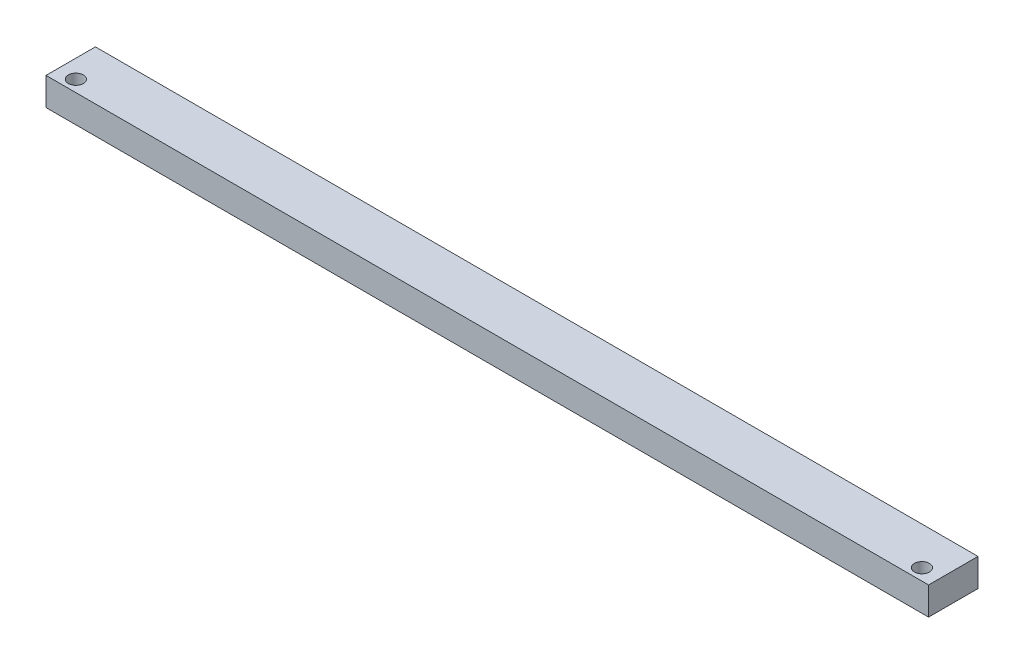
from build123d import *

# Parameters (mm, degrees)
SKETCH1_W           = 125.3744
SKETCH1_H           = 7.0231
SKETCH1_R           = 1.0668
BOSS_EXTRUDE1_DEPTH = 3.9624


with BuildPart() as part:
    # Sketch1 → Boss-Extrude1 (new body)
    with BuildSketch(Plane(origin=(0, 0, 0), x_dir=(1, 0, 0), z_dir=(0, 1, 0))):
        with Locations((17.0509184, 8.0250284)):
            Rectangle(SKETCH1_W, SKETCH1_H)
        with Locations(Location((77.1473184, 6.1644784, 0), (0, 0, 270))):
            Circle(SKETCH1_R, mode=Mode.SUBTRACT)
        with Locations(Location((-43.0454816, 6.1644784, 0), (0, 0, 90))):
            Circle(SKETCH1_R, mode=Mode.SUBTRACT)
    extrude(amount=BOSS_EXTRUDE1_DEPTH)


solid = part.part
